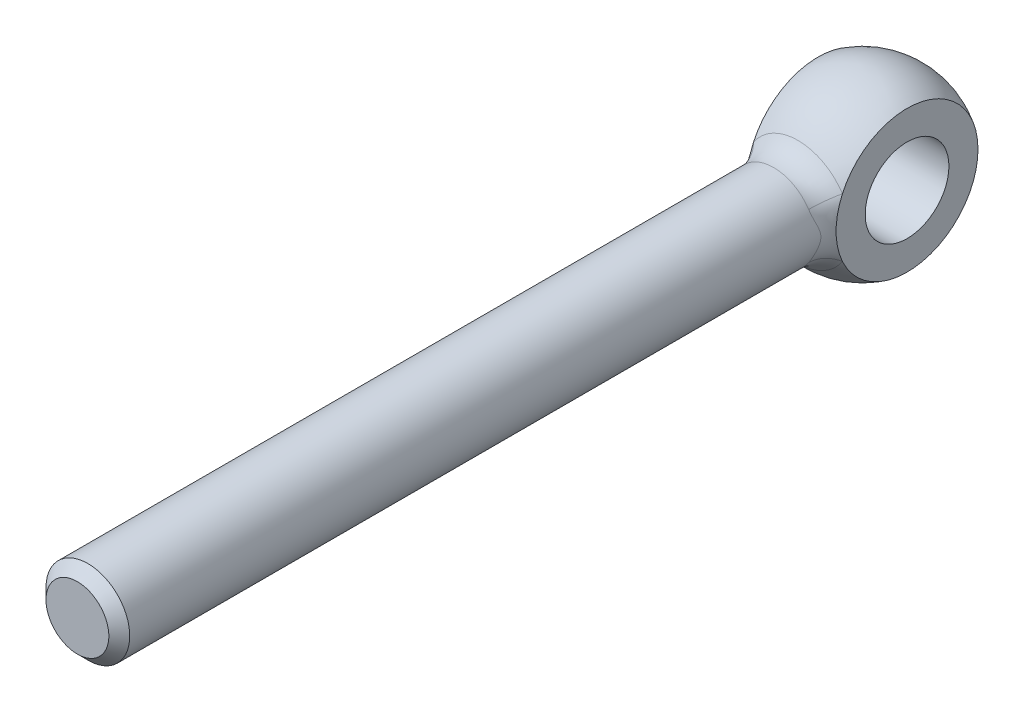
ISO-10303-21;
HEADER;
FILE_DESCRIPTION(('STEP AP214'),'2;1');
FILE_NAME('part.step','',(''),(''),'','','');
FILE_SCHEMA(('AUTOMOTIVE_DESIGN { 1 0 10303 214 1 1 1 1 }'));
ENDSEC;
DATA;
#1=APPLICATION_CONTEXT('core data for automotive mechanical design processes');
#2=APPLICATION_PROTOCOL_DEFINITION('international standard','automotive_design',2000,#1);
#3=PRODUCT_CONTEXT('',#1,'mechanical');
#4=PRODUCT('Part','Part','',(#3));
#5=PRODUCT_RELATED_PRODUCT_CATEGORY('part','',(#4));
#6=PRODUCT_DEFINITION_FORMATION('','',#4);
#7=PRODUCT_DEFINITION_CONTEXT('part definition',#1,'design');
#8=PRODUCT_DEFINITION('design','',#6,#7);
#9=PRODUCT_DEFINITION_SHAPE('','',#8);
#10=(LENGTH_UNIT() NAMED_UNIT(*) SI_UNIT(.MILLI.,.METRE.));
#11=(NAMED_UNIT(*) PLANE_ANGLE_UNIT() SI_UNIT($,.RADIAN.));
#12=(NAMED_UNIT(*) SI_UNIT($,.STERADIAN.) SOLID_ANGLE_UNIT());
#13=UNCERTAINTY_MEASURE_WITH_UNIT(LENGTH_MEASURE(1.E-05),#10,'distance_accuracy_value','');
#14=(GEOMETRIC_REPRESENTATION_CONTEXT(3) GLOBAL_UNCERTAINTY_ASSIGNED_CONTEXT((#13)) GLOBAL_UNIT_ASSIGNED_CONTEXT((#10,
#11,#12)) REPRESENTATION_CONTEXT('',''));
#15=CARTESIAN_POINT('',(0.,0.,0.));
#16=DIRECTION('',(0.,0.,1.));
#17=DIRECTION('',(1.,0.,0.));
#18=AXIS2_PLACEMENT_3D('',#15,#16,#17);
#19=CARTESIAN_POINT('',(0.,0.,0.));
#20=DIRECTION('',(1.,0.,0.));
#21=DIRECTION('',(0.,0.,-1.));
#22=AXIS2_PLACEMENT_3D('',#19,#20,#21);
#23=SPHERICAL_SURFACE('',#22,16.);
#24=CARTESIAN_POINT('',(-8.5,0.,0.));
#25=DIRECTION('',(-1.,0.,0.));
#26=DIRECTION('',(0.,0.,1.));
#27=AXIS2_PLACEMENT_3D('',#24,#25,#26);
#28=CIRCLE('',#27,13.555441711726);
#29=CARTESIAN_POINT('',(-8.5,-5.60530297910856,12.3422274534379));
#30=VERTEX_POINT('',#29);
#31=CARTESIAN_POINT('',(-8.5,5.60530297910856,12.3422274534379));
#32=VERTEX_POINT('',#31);
#33=EDGE_CURVE('E254',#30,#32,#28,.F.);
#34=ORIENTED_EDGE('',*,*,#33,.T.);
#35=CARTESIAN_POINT('',(0.,0.,12.3422274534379));
#36=DIRECTION('',(0.,0.,-1.));
#37=DIRECTION('',(-1.,0.,0.));
#38=AXIS2_PLACEMENT_3D('',#35,#36,#37);
#39=CIRCLE('',#38,10.1818181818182);
#40=CARTESIAN_POINT('',(8.5,5.60530297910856,12.3422274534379));
#41=VERTEX_POINT('',#40);
#42=EDGE_CURVE('E73',#32,#41,#39,.T.);
#43=ORIENTED_EDGE('',*,*,#42,.T.);
#44=CARTESIAN_POINT('',(8.5,0.,0.));
#45=DIRECTION('',(-1.,0.,0.));
#46=DIRECTION('',(0.,0.,1.));
#47=AXIS2_PLACEMENT_3D('',#44,#45,#46);
#48=CIRCLE('',#47,13.555441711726);
#49=CARTESIAN_POINT('',(8.5,-5.60530297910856,12.3422274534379));
#50=VERTEX_POINT('',#49);
#51=EDGE_CURVE('E61',#50,#41,#48,.F.);
#52=ORIENTED_EDGE('',*,*,#51,.F.);
#53=CARTESIAN_POINT('',(0.,0.,12.3422274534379));
#54=DIRECTION('',(0.,0.,-1.));
#55=DIRECTION('',(-1.,0.,0.));
#56=AXIS2_PLACEMENT_3D('',#53,#54,#55);
#57=CIRCLE('',#56,10.1818181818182);
#58=EDGE_CURVE('E70',#50,#30,#57,.T.);
#59=ORIENTED_EDGE('',*,*,#58,.T.);
#60=EDGE_LOOP('',(#34,#43,#52,#59));
#61=FACE_BOUND('',#60,.T.);
#62=ADVANCED_FACE('F14',(#61),#23,.T.);
#63=CARTESIAN_POINT('',(0.,0.,-10.));
#64=DIRECTION('',(0.,0.,-1.));
#65=DIRECTION('',(-1.,0.,0.));
#66=AXIS2_PLACEMENT_3D('',#63,#64,#65);
#67=CYLINDRICAL_SURFACE('',#66,8.);
#68=CARTESIAN_POINT('',(-8.5,-7.21404610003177,11.4763904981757));
#69=CARTESIAN_POINT('',(-6.09468235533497,-5.27266467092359,13.1301048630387));
#70=CARTESIAN_POINT('',(-5.37414329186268,-5.92609347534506,16.4980627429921));
#71=CARTESIAN_POINT('',(-8.5,-7.11248170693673,11.5402194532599));
#72=CARTESIAN_POINT('',(-6.12063583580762,-5.22673392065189,13.2143748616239));
#73=CARTESIAN_POINT('',(-5.47521745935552,-5.83447064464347,16.5670395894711));
#74=CARTESIAN_POINT('',(-8.5,-7.00912010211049,11.6033252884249));
#75=CARTESIAN_POINT('',(-6.15011431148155,-5.17869850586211,13.2964414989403));
#76=CARTESIAN_POINT('',(-5.57488056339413,-5.73934357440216,16.6279432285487));
#77=CARTESIAN_POINT('',(-8.5,-6.7982397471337,11.7281301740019));
#78=CARTESIAN_POINT('',(-6.215692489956,-5.07719834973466,13.4551022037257));
#79=CARTESIAN_POINT('',(-5.77047286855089,-5.54263123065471,16.7342322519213));
#80=CARTESIAN_POINT('',(-8.5,-6.6907209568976,11.7898292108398));
#81=CARTESIAN_POINT('',(-6.25173729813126,-5.02378952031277,13.5316930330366));
#82=CARTESIAN_POINT('',(-5.86640203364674,-5.44104589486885,16.7796174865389));
#83=CARTESIAN_POINT('',(-8.5,-6.47156647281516,11.9115249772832));
#84=CARTESIAN_POINT('',(-6.32984302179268,-4.91051988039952,13.6784476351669));
#85=CARTESIAN_POINT('',(-6.05310068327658,-5.23254090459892,16.8552890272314));
#86=CARTESIAN_POINT('',(-8.5,-6.3599565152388,11.9715291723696));
#87=CARTESIAN_POINT('',(-6.37181368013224,-4.85076320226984,13.7486505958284));
#88=CARTESIAN_POINT('',(-6.14389552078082,-5.12565346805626,16.8856565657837));
#89=CARTESIAN_POINT('',(-8.5,-6.13156871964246,12.0900958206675));
#90=CARTESIAN_POINT('',(-6.46106207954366,-4.72338837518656,13.8824437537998));
#91=CARTESIAN_POINT('',(-6.32014497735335,-4.90667898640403,16.9324624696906));
#92=CARTESIAN_POINT('',(-8.5,-6.01479321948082,12.1486589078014));
#93=CARTESIAN_POINT('',(-6.50828789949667,-4.65584636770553,13.9460595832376));
#94=CARTESIAN_POINT('',(-6.40560197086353,-4.79459429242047,16.9489070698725));
#95=CARTESIAN_POINT('',(-8.5,-5.84778357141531,12.2293170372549));
#96=CARTESIAN_POINT('',(-6.57728162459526,-4.55517969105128,14.0300382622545));
#97=CARTESIAN_POINT('',(-6.52079058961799,-4.63491294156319,16.9628056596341));
#98=CARTESIAN_POINT('',(-8.5,-5.79993799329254,12.252084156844));
#99=CARTESIAN_POINT('',(-6.59714554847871,-4.52598470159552,14.0532625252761));
#100=CARTESIAN_POINT('',(-6.55301829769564,-4.58923484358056,16.9657309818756));
#101=CARTESIAN_POINT('',(-8.5,-5.70332504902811,12.2973545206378));
#102=CARTESIAN_POINT('',(-6.63743945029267,-4.46617383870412,14.0985544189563));
#103=CARTESIAN_POINT('',(-6.61651666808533,-4.49720278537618,16.969609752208));
#104=CARTESIAN_POINT('',(-8.5,-5.65455783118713,12.3198578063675));
#105=CARTESIAN_POINT('',(-6.6578672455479,-4.43556289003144,14.1206247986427));
#106=CARTESIAN_POINT('',(-6.64778748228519,-4.45084893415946,16.9705635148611));
#107=CARTESIAN_POINT('',(-8.5,-5.44499233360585,12.4150343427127));
#108=CARTESIAN_POINT('',(-6.74556355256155,-4.30257834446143,14.2117377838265));
#109=CARTESIAN_POINT('',(-6.7787644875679,-4.25222888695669,16.9705602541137));
#110=CARTESIAN_POINT('',(-8.5,-5.27951608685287,12.4864255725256));
#111=CARTESIAN_POINT('',(-6.81544368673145,-4.1927768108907,14.2754759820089));
#112=CARTESIAN_POINT('',(-6.8738000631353,-4.09681174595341,16.9604462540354));
#113=CARTESIAN_POINT('',(-8.5,-4.93715685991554,12.6257147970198));
#114=CARTESIAN_POINT('',(-6.95729458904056,-3.95635337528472,14.389624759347));
#115=CARTESIAN_POINT('',(-7.052814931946,-3.7803320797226,16.9224918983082));
#116=CARTESIAN_POINT('',(-8.5,-4.76026476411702,12.6936099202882));
#117=CARTESIAN_POINT('',(-7.0292537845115,-3.82985839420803,14.4401471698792));
#118=CARTESIAN_POINT('',(-7.13678522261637,-3.61926509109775,16.8946372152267));
#119=CARTESIAN_POINT('',(-8.5,-4.39291482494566,12.8253889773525));
#120=CARTESIAN_POINT('',(-7.17229161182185,-3.55899929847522,14.527893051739));
#121=CARTESIAN_POINT('',(-7.29368177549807,-3.29171337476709,16.8239398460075));
#122=CARTESIAN_POINT('',(-8.5,-4.20238277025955,12.8892467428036));
#123=CARTESIAN_POINT('',(-7.24340117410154,-3.41463018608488,14.5651704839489));
#124=CARTESIAN_POINT('',(-7.36653960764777,-3.12520218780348,16.7810092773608));
#125=CARTESIAN_POINT('',(-8.5,-3.80753809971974,13.011354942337));
#126=CARTESIAN_POINT('',(-7.38096321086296,-3.10891477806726,14.6265101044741));
#127=CARTESIAN_POINT('',(-7.50042091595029,-2.78863622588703,16.6838597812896));
#128=CARTESIAN_POINT('',(-8.5,-3.60322970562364,13.0696070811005));
#129=CARTESIAN_POINT('',(-7.44749590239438,-2.94761815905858,14.6507009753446));
#130=CARTESIAN_POINT('',(-7.5614479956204,-2.61858254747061,16.6296443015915));
#131=CARTESIAN_POINT('',(-8.5,-3.17298584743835,13.1807823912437));
#132=CARTESIAN_POINT('',(-7.57474759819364,-2.60343332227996,14.6877992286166));
#133=CARTESIAN_POINT('',(-7.6733842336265,-2.27017167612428,16.5128228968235));
#134=CARTESIAN_POINT('',(-8.5,-2.94657965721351,13.2334877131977));
#135=CARTESIAN_POINT('',(-7.63536024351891,-2.41996241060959,14.7004519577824));
#136=CARTESIAN_POINT('',(-7.72392626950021,-2.09171968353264,16.4500108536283));
#137=CARTESIAN_POINT('',(-8.5,-2.47625290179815,13.329510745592));
#138=CARTESIAN_POINT('',(-7.74529937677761,-2.03634776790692,14.7158200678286));
#139=CARTESIAN_POINT('',(-7.81254675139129,-1.73163043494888,16.3242586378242));
#140=CARTESIAN_POINT('',(-8.5,-2.23231936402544,13.372821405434));
#141=CARTESIAN_POINT('',(-7.79475745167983,-1.83605562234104,14.7186001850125));
#142=CARTESIAN_POINT('',(-7.85061584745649,-1.54999089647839,16.2613184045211));
#143=CARTESIAN_POINT('',(-8.5,-1.72932083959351,13.4470484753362));
#144=CARTESIAN_POINT('',(-7.8788717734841,-1.42253007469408,14.7183148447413));
#145=CARTESIAN_POINT('',(-7.91382421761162,-1.18541297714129,16.1458563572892));
#146=CARTESIAN_POINT('',(-8.5,-1.47045127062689,13.4780956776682));
#147=CARTESIAN_POINT('',(-7.91381483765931,-1.20922522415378,14.7153404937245));
#148=CARTESIAN_POINT('',(-7.93910079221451,-1.00251072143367,16.0932277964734));
#149=CARTESIAN_POINT('',(-8.5,-1.07148728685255,13.5136874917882));
#150=CARTESIAN_POINT('',(-7.95363162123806,-0.880715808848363,14.7104020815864));
#151=CARTESIAN_POINT('',(-7.96751724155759,-0.726106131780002,16.0305359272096));
#152=CARTESIAN_POINT('',(-8.5,-0.9368122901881,13.5237186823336));
#153=CARTESIAN_POINT('',(-7.96480566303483,-0.769915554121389,14.7086788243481));
#154=CARTESIAN_POINT('',(-7.97540430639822,-0.633689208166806,16.0123535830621));
#155=CARTESIAN_POINT('',(-8.5,-0.664802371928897,13.539814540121));
#156=CARTESIAN_POINT('',(-7.98269305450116,-0.546269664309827,14.7056669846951));
#157=CARTESIAN_POINT('',(-7.98796994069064,-0.448291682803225,15.9827925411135));
#158=CARTESIAN_POINT('',(-8.5,-0.527468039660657,13.5458800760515));
#159=CARTESIAN_POINT('',(-7.98941651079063,-0.433369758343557,14.7043770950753));
#160=CARTESIAN_POINT('',(-7.99264921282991,-0.355311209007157,15.9714123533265));
#161=CARTESIAN_POINT('',(-8.5,-0.239654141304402,13.5541505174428));
#162=CARTESIAN_POINT('',(-7.99857317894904,-0.196892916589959,14.7025804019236));
#163=CARTESIAN_POINT('',(-7.99901593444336,-0.161126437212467,15.9558343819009));
#164=CARTESIAN_POINT('',(-8.5,-0.0890478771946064,13.5559842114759));
#165=CARTESIAN_POINT('',(-8.00059991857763,-0.0731434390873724,14.7021481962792));
#166=CARTESIAN_POINT('',(-8.00041586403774,-0.0598937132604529,15.9523278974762));
#167=CARTESIAN_POINT('',(-8.5,0.211895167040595,13.5546208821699));
#168=CARTESIAN_POINT('',(-7.9990922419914,0.174066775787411,14.7024570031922));
#169=CARTESIAN_POINT('',(-7.99937082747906,0.142512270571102,15.9549155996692));
#170=CARTESIAN_POINT('',(-8.5,0.362231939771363,13.5514237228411));
#171=CARTESIAN_POINT('',(-7.9955567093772,0.297606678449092,14.7031982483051));
#172=CARTESIAN_POINT('',(-7.99692575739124,0.243685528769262,15.961010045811));
#173=CARTESIAN_POINT('',(-8.5,0.660964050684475,13.5401445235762));
#174=CARTESIAN_POINT('',(-7.98305803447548,0.543100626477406,14.7055724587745));
#175=CARTESIAN_POINT('',(-7.98821555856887,0.445703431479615,15.9821361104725));
#176=CARTESIAN_POINT('',(-8.5,0.809356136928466,13.5320551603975));
#177=CARTESIAN_POINT('',(-7.97407893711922,0.665127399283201,14.7072081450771));
#178=CARTESIAN_POINT('',(-7.98194470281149,0.546547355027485,15.9971811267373));
#179=CARTESIAN_POINT('',(-8.5,1.10250796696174,13.5113317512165));
#180=CARTESIAN_POINT('',(-7.9510017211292,0.906226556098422,14.7107414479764));
#181=CARTESIAN_POINT('',(-7.96564184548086,0.74747091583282,16.0347055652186));
#182=CARTESIAN_POINT('',(-8.5,1.24726738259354,13.4986972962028));
#183=CARTESIAN_POINT('',(-7.93688956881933,1.02536545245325,14.7126404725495));
#184=CARTESIAN_POINT('',(-7.95560950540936,0.847550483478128,16.0571856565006));
#185=CARTESIAN_POINT('',(-8.5,1.53378246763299,13.4691681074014));
#186=CARTESIAN_POINT('',(-7.90378045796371,1.26114754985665,14.715921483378));
#187=CARTESIAN_POINT('',(-7.93172247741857,1.04788711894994,16.1079466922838));
#188=CARTESIAN_POINT('',(-8.5,1.67548812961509,13.4522283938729));
#189=CARTESIAN_POINT('',(-7.88471399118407,1.37780407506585,14.7172974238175));
#190=CARTESIAN_POINT('',(-7.91782727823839,1.14813420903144,16.1362882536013));
#191=CARTESIAN_POINT('',(-8.5,1.95382048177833,13.4146307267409));
#192=CARTESIAN_POINT('',(-7.84223580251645,1.60676183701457,14.7186738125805));
#193=CARTESIAN_POINT('',(-7.88631338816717,1.34768986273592,16.1966383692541));
#194=CARTESIAN_POINT('',(-8.5,2.09044619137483,13.3939720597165));
#195=CARTESIAN_POINT('',(-7.81880220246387,1.71910774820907,14.7186709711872));
#196=CARTESIAN_POINT('',(-7.86869398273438,1.44699824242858,16.2286476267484));
#197=CARTESIAN_POINT('',(-8.5,2.3584137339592,13.3493943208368));
#198=CARTESIAN_POINT('',(-7.76807987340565,1.93905894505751,14.7165469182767));
#199=CARTESIAN_POINT('',(-7.82977168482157,1.64463169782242,16.2945243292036));
#200=CARTESIAN_POINT('',(-8.5,2.48975817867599,13.3254768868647));
#201=CARTESIAN_POINT('',(-7.74077070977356,2.04670100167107,14.714420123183));
#202=CARTESIAN_POINT('',(-7.8084706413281,1.74295724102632,16.3283908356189));
#203=CARTESIAN_POINT('',(-8.5,2.7473176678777,13.274768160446));
#204=CARTESIAN_POINT('',(-7.68276575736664,2.25711370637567,14.7074369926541));
#205=CARTESIAN_POINT('',(-7.76218797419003,1.93869867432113,16.3964859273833));
#206=CARTESIAN_POINT('',(-8.5,2.87353237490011,13.2479766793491));
#207=CARTESIAN_POINT('',(-7.65204732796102,2.35990797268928,14.7025700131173));
#208=CARTESIAN_POINT('',(-7.73720610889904,2.03611450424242,16.4307145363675));
#209=CARTESIAN_POINT('',(-8.5,3.20930744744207,13.1718509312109));
#210=CARTESIAN_POINT('',(-7.56463249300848,2.6324037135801,14.6849450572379));
#211=CARTESIAN_POINT('',(-7.66441324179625,2.29923751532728,16.5223425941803));
#212=CARTESIAN_POINT('',(-8.5,3.41408001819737,13.1200716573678));
#213=CARTESIAN_POINT('',(-7.50515068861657,2.79695169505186,14.6690169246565));
#214=CARTESIAN_POINT('',(-7.61303164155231,2.46407698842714,16.5788489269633));
#215=CARTESIAN_POINT('',(-8.5,3.81011206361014,13.0105817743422));
#216=CARTESIAN_POINT('',(-7.38026116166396,3.11070989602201,14.6259549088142));
#217=CARTESIAN_POINT('',(-7.49942504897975,2.79079244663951,16.6841164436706));
#218=CARTESIAN_POINT('',(-8.5,4.00137310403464,12.9528718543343));
#219=CARTESIAN_POINT('',(-7.31476500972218,3.2599243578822,14.5987244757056));
#220=CARTESIAN_POINT('',(-7.4372013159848,2.95266877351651,16.7328785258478));
#221=CARTESIAN_POINT('',(-8.5,4.37000544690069,12.8331713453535));
#222=CARTESIAN_POINT('',(-7.18112598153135,3.5415527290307,14.5324431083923));
#223=CARTESIAN_POINT('',(-7.30250701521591,3.27155812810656,16.8185636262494));
#224=CARTESIAN_POINT('',(-8.5,4.54747917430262,12.7712204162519));
#225=CARTESIAN_POINT('',(-7.11294809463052,3.67405011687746,14.4933793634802));
#226=CARTESIAN_POINT('',(-7.2301261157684,3.42860043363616,16.8555818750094));
#227=CARTESIAN_POINT('',(-8.5,4.89131268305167,12.6435234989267));
#228=CARTESIAN_POINT('',(-6.97624175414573,3.92367860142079,14.4030930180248));
#229=CARTESIAN_POINT('',(-7.07492374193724,3.73837581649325,16.9153731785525));
#230=CARTESIAN_POINT('',(-8.5,5.05767311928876,12.5777777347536));
#231=CARTESIAN_POINT('',(-6.90769393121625,4.0407111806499,14.351757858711));
#232=CARTESIAN_POINT('',(-6.99210288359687,3.89110914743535,16.938147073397));
#233=CARTESIAN_POINT('',(-8.5,5.36183242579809,12.4508919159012));
#234=CARTESIAN_POINT('',(-6.78083422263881,4.24724413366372,14.2438012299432));
#235=CARTESIAN_POINT('',(-6.82646896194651,4.17409181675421,16.9653278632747));
#236=CARTESIAN_POINT('',(-8.5,5.50072306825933,12.3900837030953));
#237=CARTESIAN_POINT('',(-6.72220835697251,4.3383567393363,14.1883306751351));
#238=CARTESIAN_POINT('',(-6.74473582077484,4.3049164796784,16.9715357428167));
#239=CARTESIAN_POINT('',(-8.5,5.77121151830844,12.266426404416));
#240=CARTESIAN_POINT('',(-6.60877160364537,4.50955407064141,14.0685302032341));
#241=CARTESIAN_POINT('',(-6.57387157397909,4.56157646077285,16.969341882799));
#242=CARTESIAN_POINT('',(-8.5,5.90281103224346,12.2035778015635));
#243=CARTESIAN_POINT('',(-6.55399775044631,4.58954375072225,14.004143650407));
#244=CARTESIAN_POINT('',(-6.48474221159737,4.6874129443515,16.9609435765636));
#245=CARTESIAN_POINT('',(-8.5,6.1613047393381,12.0751601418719));
#246=CARTESIAN_POINT('',(-6.44915440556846,4.74066397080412,13.8661465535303));
#247=CARTESIAN_POINT('',(-6.29833410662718,4.93511082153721,16.9279706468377));
#248=CARTESIAN_POINT('',(-8.5,6.28810151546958,12.0095646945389));
#249=CARTESIAN_POINT('',(-6.3992307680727,4.81153733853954,13.7923798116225));
#250=CARTESIAN_POINT('',(-6.2009549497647,5.05688675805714,16.9031603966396));
#251=CARTESIAN_POINT('',(-8.5,6.5357434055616,11.8766028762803));
#252=CARTESIAN_POINT('',(-6.30620115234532,4.94457342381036,13.637089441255));
#253=CARTESIAN_POINT('',(-6.00003403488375,5.29375902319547,16.8359566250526));
#254=CARTESIAN_POINT('',(-8.5,6.65658306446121,11.8092349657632));
#255=CARTESIAN_POINT('',(-6.26317251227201,5.00663411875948,13.5555369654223));
#256=CARTESIAN_POINT('',(-5.89648681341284,5.40884924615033,16.7935473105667));
#257=CARTESIAN_POINT('',(-8.5,6.77474698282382,11.7410733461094));
#258=CARTESIAN_POINT('',(-6.22436009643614,5.06487398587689,13.4708703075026));
#259=CARTESIAN_POINT('',(-5.79035913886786,5.52012146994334,16.7417712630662));
#260=(BOUNDED_SURFACE() B_SPLINE_SURFACE(3,2,((#68,#69,#70),(#71,#72,#73),(#74,#75,#76),(#77,
#78,#79),(#80,#81,#82),(#83,#84,#85),(#86,#87,#88),(#89,#90,#91),(#92,#93,#94),(#95,#96,#97),
(#98,#99,#100),(#101,#102,#103),(#104,#105,#106),(#107,#108,#109),(#110,#111,#112),(#113,#114,
#115),(#116,#117,#118),(#119,#120,#121),(#122,#123,#124),(#125,#126,#127),(#128,#129,#130),
(#131,#132,#133),(#134,#135,#136),(#137,#138,#139),(#140,#141,#142),(#143,#144,#145),(#146,#147,
#148),(#149,#150,#151),(#152,#153,#154),(#155,#156,#157),(#158,#159,#160),(#161,#162,#163),
(#164,#165,#166),(#167,#168,#169),(#170,#171,#172),(#173,#174,#175),(#176,#177,#178),(#179,#180,
#181),(#182,#183,#184),(#185,#186,#187),(#188,#189,#190),(#191,#192,#193),(#194,#195,#196),
(#197,#198,#199),(#200,#201,#202),(#203,#204,#205),(#206,#207,#208),(#209,#210,#211),(#212,#213,
#214),(#215,#216,#217),(#218,#219,#220),(#221,#222,#223),(#224,#225,#226),(#227,#228,#229),
(#230,#231,#232),(#233,#234,#235),(#236,#237,#238),(#239,#240,#241),(#242,#243,#244),(#245,#246,
#247),(#248,#249,#250),(#251,#252,#253),(#254,#255,#256),(#257,#258,#259)),.UNSPECIFIED.,.F.,
.F.,.F.) B_SPLINE_SURFACE_WITH_KNOTS((4,2,2,2,2,2,2,2,2,2,2,2,2,2,2,2,2,2,2,2,2,2,2,2,2,2,2,2,2,
2,2,4),(3,3),(0.,0.745231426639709,1.49047004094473,2.23163223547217,2.97246235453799,
3.26605012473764,3.55959104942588,4.51498393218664,5.47114937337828,6.43298377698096,
7.39452475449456,8.38551461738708,9.37724565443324,10.3580939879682,10.8478915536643,
11.3375817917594,11.8688190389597,12.4000706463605,12.9321194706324,13.4642161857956,
14.002118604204,14.5401243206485,15.0778606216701,15.6156322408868,16.5371108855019,
17.4584825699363,18.3721796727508,19.2858228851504,20.0950945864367,20.9041760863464,
21.7251332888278,22.5468288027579),(0.,1.),
.UNSPECIFIED.) GEOMETRIC_REPRESENTATION_ITEM() RATIONAL_B_SPLINE_SURFACE(((1.,0.863427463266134,
1.),(1.,0.865862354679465,1.),(1.,0.868408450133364,1.),(1.,0.873700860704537,1.),(1.,
0.876447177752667,1.),(1.,0.882102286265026,1.),(1.,0.885010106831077,1.),(1.,0.89096432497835,
1.),(1.,0.89401065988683,1.),(1.,0.898329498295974,1.),(1.,0.89956260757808,1.),(1.,
0.90204033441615,1.),(1.,0.903284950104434,1.),(1.,0.908599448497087,1.),(1.,0.91271219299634,
1.),(1.,0.920912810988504,1.),(1.,0.925000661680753,1.),(1.,0.933046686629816,1.),(1.,
0.937003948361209,1.),(1.,0.94462957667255,1.),(1.,0.948298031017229,1.),(1.,0.955318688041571,
1.),(1.,0.958657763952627,1.),(1.,0.964735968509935,1.),(1.,0.967474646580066,1.),(1.,
0.972155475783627,1.),(1.,0.974106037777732,1.),(1.,0.976336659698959,1.),(1.,0.976964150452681,
1.),(1.,0.97797010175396,1.),(1.,0.978348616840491,1.),(1.,0.978864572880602,1.),(1.,
0.978978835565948,1.),(1.,0.978893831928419,1.),(1.,0.978694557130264,1.),(1.,0.977990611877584,
1.),(1.,0.977485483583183,1.),(1.,0.97618905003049,1.),(1.,0.97539771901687,1.),(1.,
0.973544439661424,1.),(1.,0.972479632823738,1.),(1.,0.970111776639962,1.),(1.,0.968808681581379,
1.),(1.,0.96599281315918,1.),(1.,0.96448014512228,1.),(1.,0.961271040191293,1.),(1.,
0.959574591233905,1.),(1.,0.954755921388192,1.),(1.,0.951480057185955,1.),(1.,0.944585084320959,
1.),(1.,0.940966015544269,1.),(1.,0.933532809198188,1.),(1.,0.929720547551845,1.),(1.,
0.92198630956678,1.),(1.,0.91806433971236,1.),(1.,0.910668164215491,1.),(1.,0.907193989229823,
1.),(1.,0.900316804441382,1.),(1.,0.896913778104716,1.),(1.,0.890194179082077,1.),(1.,
0.886879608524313,1.),(1.,0.880439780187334,1.),(1.,0.877314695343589,1.),(1.,0.874312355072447,1.))) REPRESENTATION_ITEM('') SURFACE());
#261=CARTESIAN_POINT('',(-5.79035913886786,5.52012146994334,16.7417712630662));
#262=CARTESIAN_POINT('',(-5.89648681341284,5.40884924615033,16.7935473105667));
#263=CARTESIAN_POINT('',(-6.00003403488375,5.29375902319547,16.8359566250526));
#264=CARTESIAN_POINT('',(-6.2009549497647,5.05688675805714,16.9031603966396));
#265=CARTESIAN_POINT('',(-6.29833410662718,4.93511082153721,16.9279706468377));
#266=CARTESIAN_POINT('',(-6.48474221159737,4.6874129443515,16.9609435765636));
#267=CARTESIAN_POINT('',(-6.57387157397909,4.56157646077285,16.969341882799));
#268=CARTESIAN_POINT('',(-6.74473582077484,4.3049164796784,16.9715357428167));
#269=CARTESIAN_POINT('',(-6.82646896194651,4.1740918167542,16.9653278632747));
#270=CARTESIAN_POINT('',(-6.99210288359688,3.89110914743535,16.938147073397));
#271=CARTESIAN_POINT('',(-7.07492374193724,3.73837581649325,16.9153731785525));
#272=CARTESIAN_POINT('',(-7.2301261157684,3.42860043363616,16.8555818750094));
#273=CARTESIAN_POINT('',(-7.30250701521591,3.27155812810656,16.8185636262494));
#274=CARTESIAN_POINT('',(-7.4372013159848,2.9526687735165,16.7328785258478));
#275=CARTESIAN_POINT('',(-7.49942504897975,2.79079244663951,16.6841164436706));
#276=CARTESIAN_POINT('',(-7.61303164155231,2.46407698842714,16.5788489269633));
#277=CARTESIAN_POINT('',(-7.66441324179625,2.29923751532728,16.5223425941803));
#278=CARTESIAN_POINT('',(-7.73720610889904,2.03611450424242,16.4307145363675));
#279=CARTESIAN_POINT('',(-7.76218797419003,1.93869867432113,16.3964859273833));
#280=CARTESIAN_POINT('',(-7.8084706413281,1.74295724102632,16.3283908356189));
#281=CARTESIAN_POINT('',(-7.82977168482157,1.64463169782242,16.2945243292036));
#282=CARTESIAN_POINT('',(-7.86869398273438,1.44699824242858,16.2286476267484));
#283=CARTESIAN_POINT('',(-7.88631338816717,1.34768986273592,16.1966383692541));
#284=CARTESIAN_POINT('',(-7.91782727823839,1.14813420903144,16.1362882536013));
#285=CARTESIAN_POINT('',(-7.93172247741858,1.04788711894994,16.1079466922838));
#286=CARTESIAN_POINT('',(-7.95560950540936,0.847550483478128,16.0571856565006));
#287=CARTESIAN_POINT('',(-7.96564184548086,0.74747091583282,16.0347055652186));
#288=CARTESIAN_POINT('',(-7.98194470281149,0.546547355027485,15.9971811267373));
#289=CARTESIAN_POINT('',(-7.98821555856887,0.445703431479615,15.9821361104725));
#290=CARTESIAN_POINT('',(-7.99692575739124,0.243685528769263,15.961010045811));
#291=CARTESIAN_POINT('',(-7.99937082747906,0.142512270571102,15.9549155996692));
#292=CARTESIAN_POINT('',(-8.00041586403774,-0.0598937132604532,15.9523278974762));
#293=CARTESIAN_POINT('',(-7.99901593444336,-0.161126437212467,15.9558343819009));
#294=CARTESIAN_POINT('',(-7.99264921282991,-0.355311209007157,15.9714123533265));
#295=CARTESIAN_POINT('',(-7.98796994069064,-0.448291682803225,15.9827925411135));
#296=CARTESIAN_POINT('',(-7.97540430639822,-0.633689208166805,16.0123535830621));
#297=CARTESIAN_POINT('',(-7.96751724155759,-0.726106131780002,16.0305359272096));
#298=CARTESIAN_POINT('',(-7.93910079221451,-1.00251072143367,16.0932277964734));
#299=CARTESIAN_POINT('',(-7.91382421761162,-1.18541297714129,16.1458563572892));
#300=CARTESIAN_POINT('',(-7.85061584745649,-1.54999089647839,16.2613184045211));
#301=CARTESIAN_POINT('',(-7.81254675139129,-1.73163043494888,16.3242586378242));
#302=CARTESIAN_POINT('',(-7.72392626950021,-2.09171968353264,16.4500108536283));
#303=CARTESIAN_POINT('',(-7.6733842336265,-2.27017167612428,16.5128228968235));
#304=CARTESIAN_POINT('',(-7.5614479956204,-2.61858254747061,16.6296443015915));
#305=CARTESIAN_POINT('',(-7.50042091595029,-2.78863622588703,16.6838597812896));
#306=CARTESIAN_POINT('',(-7.36653960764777,-3.12520218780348,16.7810092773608));
#307=CARTESIAN_POINT('',(-7.29368177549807,-3.29171337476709,16.8239398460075));
#308=CARTESIAN_POINT('',(-7.13678522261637,-3.61926509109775,16.8946372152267));
#309=CARTESIAN_POINT('',(-7.052814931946,-3.7803320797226,16.9224918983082));
#310=CARTESIAN_POINT('',(-6.8738000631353,-4.09681174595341,16.9604462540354));
#311=CARTESIAN_POINT('',(-6.7787644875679,-4.25222888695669,16.9705602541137));
#312=CARTESIAN_POINT('',(-6.64778748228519,-4.45084893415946,16.9705635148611));
#313=CARTESIAN_POINT('',(-6.61651666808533,-4.49720278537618,16.969609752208));
#314=CARTESIAN_POINT('',(-6.55301829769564,-4.58923484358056,16.9657309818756));
#315=CARTESIAN_POINT('',(-6.52079058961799,-4.63491294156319,16.9628056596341));
#316=CARTESIAN_POINT('',(-6.40560197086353,-4.79459429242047,16.9489070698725));
#317=CARTESIAN_POINT('',(-6.32014497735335,-4.90667898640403,16.9324624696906));
#318=CARTESIAN_POINT('',(-6.14389552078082,-5.12565346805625,16.8856565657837));
#319=CARTESIAN_POINT('',(-6.05310068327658,-5.23254090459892,16.8552890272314));
#320=CARTESIAN_POINT('',(-5.86640203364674,-5.44104589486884,16.7796174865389));
#321=CARTESIAN_POINT('',(-5.77047286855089,-5.54263123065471,16.7342322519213));
#322=CARTESIAN_POINT('',(-5.57488056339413,-5.73934357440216,16.6279432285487));
#323=CARTESIAN_POINT('',(-5.47521745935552,-5.83447064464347,16.5670395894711));
#324=CARTESIAN_POINT('',(-5.37414329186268,-5.92609347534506,16.4980627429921));
#325=B_SPLINE_CURVE_WITH_KNOTS('',3,(#261,#262,#263,#264,#265,#266,#267,#268,#269,#270,#271,
#272,#273,#274,#275,#276,#277,#278,#279,#280,#281,#282,#283,#284,#285,#286,#287,#288,#289,#290,
#291,#292,#293,#294,#295,#296,#297,#298,#299,#300,#301,#302,#303,#304,#305,#306,#307,#308,#309,
#310,#311,#312,#313,#314,#315,#316,#317,#318,#319,#320,#321,#322,#323,#324),.UNSPECIFIED.,.F.,
.F.,(4,2,2,2,2,2,2,2,2,2,2,2,2,2,2,2,2,2,2,2,2,2,2,2,2,2,2,2,2,2,2,4),(0.,0.821695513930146,
1.64265271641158,2.45173421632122,3.26100591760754,4.17464913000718,5.08834623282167,
6.00971791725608,6.93119656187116,7.46896818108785,8.00670448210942,8.54471019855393,
9.08261261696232,9.61470933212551,10.1467581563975,10.6780097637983,11.2092470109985,
11.6989372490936,12.1887348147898,13.1695831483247,14.1613141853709,15.1523040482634,
16.113845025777,17.0756794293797,18.0318448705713,18.9872377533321,19.2807786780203,
19.57436644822,20.3151965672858,21.0563587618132,21.8015973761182,22.5468288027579),.UNSPECIFIED.);
#326=CARTESIAN_POINT('',(-6.67857142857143,4.40416662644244,16.9705627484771));
#327=VERTEX_POINT('',#326);
#328=CARTESIAN_POINT('',(-6.67857142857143,-4.40416662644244,16.9705627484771));
#329=VERTEX_POINT('',#328);
#330=EDGE_CURVE('E86',#327,#329,#325,.T.);
#331=ORIENTED_EDGE('',*,*,#330,.T.);
#332=CARTESIAN_POINT('',(0.,0.,16.9705627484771));
#333=DIRECTION('',(0.,0.,-1.));
#334=DIRECTION('',(-1.,0.,0.));
#335=AXIS2_PLACEMENT_3D('',#332,#333,#334);
#336=CIRCLE('',#335,8.);
#337=CARTESIAN_POINT('',(6.67857142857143,-4.40416662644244,16.9705627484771));
#338=VERTEX_POINT('',#337);
#339=EDGE_CURVE('E9',#329,#338,#336,.F.);
#340=ORIENTED_EDGE('',*,*,#339,.T.);
#341=CARTESIAN_POINT('',(8.5,7.21404611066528,11.4763904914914));
#342=CARTESIAN_POINT('',(6.0946823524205,5.27266467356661,13.1301048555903));
#343=CARTESIAN_POINT('',(5.37414329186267,5.92609347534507,16.4980627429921));
#344=CARTESIAN_POINT('',(8.5,7.11248171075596,11.5402194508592));
#345=CARTESIAN_POINT('',(6.12063583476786,5.22673392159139,13.2143748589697));
#346=CARTESIAN_POINT('',(5.47521745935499,5.83447064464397,16.5670395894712));
#347=CARTESIAN_POINT('',(8.5,7.00912010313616,11.6033252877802));
#348=CARTESIAN_POINT('',(6.15011431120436,5.17869850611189,13.2964414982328));
#349=CARTESIAN_POINT('',(5.57488056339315,5.7393435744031,16.6279432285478));
#350=CARTESIAN_POINT('',(8.5,6.79823974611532,11.7281301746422));
#351=CARTESIAN_POINT('',(6.2156924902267,5.07719834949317,13.4551022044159));
#352=CARTESIAN_POINT('',(5.77047286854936,5.54263123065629,16.7342322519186));
#353=CARTESIAN_POINT('',(8.5,6.69072095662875,11.7898292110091));
#354=CARTESIAN_POINT('',(6.251737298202,5.02378952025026,13.5316930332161));
#355=CARTESIAN_POINT('',(5.86640203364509,5.4410458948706,16.7796174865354));
#356=CARTESIAN_POINT('',(8.5,6.47156647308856,11.9115249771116));
#357=CARTESIAN_POINT('',(6.32984302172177,4.91051988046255,13.6784476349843));
#358=CARTESIAN_POINT('',(6.05310068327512,5.23254090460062,16.8552890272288));
#359=CARTESIAN_POINT('',(8.5,6.35995651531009,11.9715291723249));
#360=CARTESIAN_POINT('',(6.37181368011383,4.85076320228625,13.7486505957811));
#361=CARTESIAN_POINT('',(6.14389552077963,5.1256534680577,16.8856565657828));
#362=CARTESIAN_POINT('',(8.5,6.13156871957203,12.0900958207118));
#363=CARTESIAN_POINT('',(6.46106207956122,4.72338837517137,13.8824437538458));
#364=CARTESIAN_POINT('',(6.32014497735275,4.90667898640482,16.932462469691));
#365=CARTESIAN_POINT('',(8.5,6.01479321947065,12.1486589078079));
#366=CARTESIAN_POINT('',(6.5082878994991,4.65584636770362,13.9460595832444));
#367=CARTESIAN_POINT('',(6.40560197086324,4.79459429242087,16.9489070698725));
#368=CARTESIAN_POINT('',(8.5,5.84778357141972,12.2293170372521));
#369=CARTESIAN_POINT('',(6.57728162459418,4.5551796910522,14.0300382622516));
#370=CARTESIAN_POINT('',(6.52079058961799,4.6349129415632,16.962805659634));
#371=CARTESIAN_POINT('',(8.5,5.79993799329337,12.2520841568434));
#372=CARTESIAN_POINT('',(6.59714554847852,4.5259847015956,14.0532625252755));
#373=CARTESIAN_POINT('',(6.55301829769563,4.58923484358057,16.9657309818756));
#374=CARTESIAN_POINT('',(8.5,5.70332504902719,12.2973545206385));
#375=CARTESIAN_POINT('',(6.63743945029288,4.466173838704,14.098554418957));
#376=CARTESIAN_POINT('',(6.61651666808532,4.49720278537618,16.969609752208));
#377=CARTESIAN_POINT('',(8.5,5.65455783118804,12.3198578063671));
#378=CARTESIAN_POINT('',(6.65786724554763,4.43556289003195,14.1206247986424));
#379=CARTESIAN_POINT('',(6.64778748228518,4.45084893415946,16.9705635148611));
#380=CARTESIAN_POINT('',(8.5,5.44499233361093,12.4150343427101));
#381=CARTESIAN_POINT('',(6.74556355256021,4.30257834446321,14.211737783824));
#382=CARTESIAN_POINT('',(6.7787644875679,4.25222888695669,16.9705602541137));
#383=CARTESIAN_POINT('',(8.5,5.27951608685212,12.4864255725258));
#384=CARTESIAN_POINT('',(6.81544368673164,4.19277681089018,14.2754759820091));
#385=CARTESIAN_POINT('',(6.8738000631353,4.09681174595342,16.9604462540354));
#386=CARTESIAN_POINT('',(8.5,4.93715685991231,12.6257147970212));
#387=CARTESIAN_POINT('',(6.95729458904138,3.95635337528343,14.3896247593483));
#388=CARTESIAN_POINT('',(7.052814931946,3.78033207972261,16.9224918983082));
#389=CARTESIAN_POINT('',(8.5,4.76026476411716,12.6936099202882));
#390=CARTESIAN_POINT('',(7.02925378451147,3.82985839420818,14.4401471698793));
#391=CARTESIAN_POINT('',(7.13678522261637,3.61926509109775,16.8946372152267));
#392=CARTESIAN_POINT('',(8.5,4.39291482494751,12.8253889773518));
#393=CARTESIAN_POINT('',(7.17229161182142,3.55899929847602,14.5278930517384));
#394=CARTESIAN_POINT('',(7.29368177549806,3.2917133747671,16.8239398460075));
#395=CARTESIAN_POINT('',(8.5,4.20238277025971,12.8892467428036));
#396=CARTESIAN_POINT('',(7.24340117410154,3.41463018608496,14.5651704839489));
#397=CARTESIAN_POINT('',(7.36653960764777,3.12520218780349,16.7810092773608));
#398=CARTESIAN_POINT('',(8.5,3.80753809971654,13.0113549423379));
#399=CARTESIAN_POINT('',(7.38096321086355,3.10891477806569,14.6265101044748));
#400=CARTESIAN_POINT('',(7.50042091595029,2.78863622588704,16.6838597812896));
#401=CARTESIAN_POINT('',(8.5,3.60322970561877,13.0696070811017));
#402=CARTESIAN_POINT('',(7.44749590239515,2.94761815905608,14.6507009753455));
#403=CARTESIAN_POINT('',(7.56144799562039,2.61858254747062,16.6296443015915));
#404=CARTESIAN_POINT('',(8.5,3.17298584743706,13.1807823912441));
#405=CARTESIAN_POINT('',(7.57474759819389,2.60343332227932,14.6877992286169));
#406=CARTESIAN_POINT('',(7.6733842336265,2.27017167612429,16.5128228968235));
#407=CARTESIAN_POINT('',(8.5,2.94657965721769,13.233487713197));
#408=CARTESIAN_POINT('',(7.63536024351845,2.41996241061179,14.7004519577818));
#409=CARTESIAN_POINT('',(7.72392626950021,2.09171968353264,16.4500108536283));
#410=CARTESIAN_POINT('',(8.5,2.47625290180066,13.3295107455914));
#411=CARTESIAN_POINT('',(7.74529937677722,2.03634776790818,14.7158200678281));
#412=CARTESIAN_POINT('',(7.81254675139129,1.73163043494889,16.3242586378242));
#413=CARTESIAN_POINT('',(8.5,2.23231936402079,13.3728214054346));
#414=CARTESIAN_POINT('',(7.7947574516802,1.8360556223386,14.7186001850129));
#415=CARTESIAN_POINT('',(7.85061584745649,1.5499908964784,16.2613184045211));
#416=CARTESIAN_POINT('',(8.5,1.72932083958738,13.4470484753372));
#417=CARTESIAN_POINT('',(7.87887177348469,1.42253007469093,14.718314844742));
#418=CARTESIAN_POINT('',(7.91382421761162,1.18541297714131,16.1458563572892));
#419=CARTESIAN_POINT('',(8.5,1.4704512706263,13.4780956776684));
#420=CARTESIAN_POINT('',(7.9138148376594,1.20922522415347,14.7153404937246));
#421=CARTESIAN_POINT('',(7.9391007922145,1.00251072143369,16.0932277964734));
#422=CARTESIAN_POINT('',(8.5,1.0714872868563,13.5136874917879));
#423=CARTESIAN_POINT('',(7.95363162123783,0.880715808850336,14.7104020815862));
#424=CARTESIAN_POINT('',(7.96751724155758,0.726106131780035,16.0305359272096));
#425=CARTESIAN_POINT('',(8.5,0.936812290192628,13.5237186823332));
#426=CARTESIAN_POINT('',(7.96480566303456,0.769915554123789,14.7086788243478));
#427=CARTESIAN_POINT('',(7.97540430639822,0.633689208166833,16.0123535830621));
#428=CARTESIAN_POINT('',(8.5,0.664802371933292,13.5398145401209));
#429=CARTESIAN_POINT('',(7.9826930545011,0.546269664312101,14.705666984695));
#430=CARTESIAN_POINT('',(7.98796994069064,0.44829168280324,15.9827925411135));
#431=CARTESIAN_POINT('',(8.5,0.527468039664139,13.5458800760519));
#432=CARTESIAN_POINT('',(7.98941651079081,0.433369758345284,14.7043770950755));
#433=CARTESIAN_POINT('',(7.99264921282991,0.355311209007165,15.9714123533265));
#434=CARTESIAN_POINT('',(8.5,0.239654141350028,13.554150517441));
#435=CARTESIAN_POINT('',(7.9985731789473,0.19689291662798,14.7025804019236));
#436=CARTESIAN_POINT('',(7.99901593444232,0.161126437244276,15.9558343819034));
#437=CARTESIAN_POINT('',(8.5,0.0890478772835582,13.5559842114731));
#438=CARTESIAN_POINT('',(8.00059991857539,0.0731434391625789,14.7021481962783));
#439=CARTESIAN_POINT('',(8.00041586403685,0.0598937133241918,15.9523278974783));
#440=CARTESIAN_POINT('',(8.5,-0.21189516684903,13.554620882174));
#441=CARTESIAN_POINT('',(7.99909224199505,-0.174066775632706,14.7024570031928));
#442=CARTESIAN_POINT('',(7.99937082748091,-0.142512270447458,15.9549155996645));
#443=CARTESIAN_POINT('',(8.5,-0.362231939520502,13.5514237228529));
#444=CARTESIAN_POINT('',(7.99555670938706,-0.297606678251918,14.7031982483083));
#445=CARTESIAN_POINT('',(7.99692575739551,-0.243685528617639,15.9610100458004));
#446=CARTESIAN_POINT('',(8.5,-0.660964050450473,13.5401445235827));
#447=CARTESIAN_POINT('',(7.98305803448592,-0.543100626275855,14.7055724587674));
#448=CARTESIAN_POINT('',(7.98821555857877,-0.445703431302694,15.9821361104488));
#449=CARTESIAN_POINT('',(8.5,-0.809356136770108,13.5320551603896));
#450=CARTESIAN_POINT('',(7.97407893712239,-0.665127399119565,14.7072081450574));
#451=CARTESIAN_POINT('',(7.98194470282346,-0.546547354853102,15.997181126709));
#452=CARTESIAN_POINT('',(8.5,-1.10250796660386,13.511331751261));
#453=CARTESIAN_POINT('',(7.95100172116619,-0.906226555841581,14.7107414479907));
#454=CARTESIAN_POINT('',(7.96564184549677,-0.747470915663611,16.0347055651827));
#455=CARTESIAN_POINT('',(8.5,-1.24726738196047,13.4986972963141));
#456=CARTESIAN_POINT('',(7.93688956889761,-1.02536545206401,14.7126404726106));
#457=CARTESIAN_POINT('',(7.95560950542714,-0.847550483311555,16.0571856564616));
#458=CARTESIAN_POINT('',(8.5,-1.53378246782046,13.4691681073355));
#459=CARTESIAN_POINT('',(7.90378045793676,-1.26114754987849,14.7159214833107));
#460=CARTESIAN_POINT('',(7.93172247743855,-1.04788711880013,16.1079466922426));
#461=CARTESIAN_POINT('',(8.5,-1.67548813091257,13.4522283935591));
#462=CARTESIAN_POINT('',(7.88471399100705,-1.37780407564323,14.7172974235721));
#463=CARTESIAN_POINT('',(7.91782727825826,-1.14813420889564,16.1362882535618));
#464=CARTESIAN_POINT('',(8.5,-1.95382048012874,13.4146307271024));
#465=CARTESIAN_POINT('',(7.84223580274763,-1.60676183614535,14.7186738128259));
#466=CARTESIAN_POINT('',(7.88631338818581,-1.3476898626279,16.1966383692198));
#467=CARTESIAN_POINT('',(8.5,-2.09044618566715,13.3939720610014));
#468=CARTESIAN_POINT('',(7.81880220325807,-1.71910774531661,14.7186709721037));
#469=CARTESIAN_POINT('',(7.86869398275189,-1.44699824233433,16.2286476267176));
#470=CARTESIAN_POINT('',(8.5,-2.35841373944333,13.3493943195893));
#471=CARTESIAN_POINT('',(7.76807987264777,-1.93905894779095,14.7165469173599));
#472=CARTESIAN_POINT('',(7.82977168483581,-1.64463169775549,16.2945243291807));
#473=CARTESIAN_POINT('',(8.5,-2.48975819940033,13.3254768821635));
#474=CARTESIAN_POINT('',(7.74077070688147,-2.04670101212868,14.7144201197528));
#475=CARTESIAN_POINT('',(7.80847064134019,-1.74295724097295,16.3283908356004));
#476=CARTESIAN_POINT('',(8.5,-2.74731764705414,13.2747681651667));
#477=CARTESIAN_POINT('',(7.68276576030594,-2.25711369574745,14.7074369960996));
#478=CARTESIAN_POINT('',(7.76218797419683,-1.93869867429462,16.396485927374));
#479=CARTESIAN_POINT('',(8.5,-2.8735322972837,13.2479766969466));
#480=CARTESIAN_POINT('',(7.65204733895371,-2.35990793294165,14.7025700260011));
#481=CARTESIAN_POINT('',(7.73720610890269,-2.03611450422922,16.4307145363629));
#482=CARTESIAN_POINT('',(8.5,-3.20930732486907,13.1718509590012));
#483=CARTESIAN_POINT('',(7.56463251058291,-2.63240365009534,14.684945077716));
#484=CARTESIAN_POINT('',(7.66441324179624,-2.2992375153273,16.5223425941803));
#485=CARTESIAN_POINT('',(8.5,-3.41407998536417,13.1200716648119));
#486=CARTESIAN_POINT('',(7.50515069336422,-2.79695167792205,14.6690169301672));
#487=CARTESIAN_POINT('',(7.6130316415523,-2.46407698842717,16.5788489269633));
#488=CARTESIAN_POINT('',(8.5,-3.81011209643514,13.0105817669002));
#489=CARTESIAN_POINT('',(7.38026115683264,-3.11070991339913,14.6259549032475));
#490=CARTESIAN_POINT('',(7.49942504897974,-2.79079244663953,16.6841164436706));
#491=CARTESIAN_POINT('',(8.5,-4.00137311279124,12.9528718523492));
#492=CARTESIAN_POINT('',(7.31476500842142,-3.25992436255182,14.598724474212));
#493=CARTESIAN_POINT('',(7.4372013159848,-2.9526687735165,16.7328785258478));
#494=CARTESIAN_POINT('',(8.5,-4.37000543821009,12.8331713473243));
#495=CARTESIAN_POINT('',(7.18112598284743,-3.54155272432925,14.5324431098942));
#496=CARTESIAN_POINT('',(7.30250701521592,-3.27155812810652,16.8185636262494));
#497=CARTESIAN_POINT('',(8.5,-4.54747917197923,12.7712204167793));
#498=CARTESIAN_POINT('',(7.11294809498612,-3.67405011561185,14.4933793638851));
#499=CARTESIAN_POINT('',(7.23012611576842,-3.42860043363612,16.8555818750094));
#500=CARTESIAN_POINT('',(8.5,-4.89131268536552,12.6435234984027));
#501=CARTESIAN_POINT('',(6.97624175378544,-3.92367860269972,14.4030930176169));
#502=CARTESIAN_POINT('',(7.07492374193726,-3.73837581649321,16.9153731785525));
#503=CARTESIAN_POINT('',(8.5,-5.05767311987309,12.5777777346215));
#504=CARTESIAN_POINT('',(6.90769393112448,-4.04071118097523,14.3517578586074));
#505=CARTESIAN_POINT('',(6.9921028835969,-3.89110914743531,16.938147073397));
#506=CARTESIAN_POINT('',(8.5,-5.36183242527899,12.4508919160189));
#507=CARTESIAN_POINT('',(6.78083422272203,-4.24724413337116,14.243801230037));
#508=CARTESIAN_POINT('',(6.82646896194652,-4.17409181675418,16.9653278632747));
#509=CARTESIAN_POINT('',(8.5,-5.50072306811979,12.3900837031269));
#510=CARTESIAN_POINT('',(6.72220835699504,-4.33835673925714,14.1883306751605));
#511=CARTESIAN_POINT('',(6.74473582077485,-4.30491647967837,16.9715357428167));
#512=CARTESIAN_POINT('',(8.5,-5.7712115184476,12.2664264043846));
#513=CARTESIAN_POINT('',(6.60877160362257,-4.50955407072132,14.0685302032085));
#514=CARTESIAN_POINT('',(6.57387157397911,-4.56157646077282,16.969341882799));
#515=CARTESIAN_POINT('',(8.5,-5.90281103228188,12.2035778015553));
#516=CARTESIAN_POINT('',(6.55399775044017,-4.58954375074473,14.0041436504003));
#517=CARTESIAN_POINT('',(6.48474221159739,-4.68741294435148,16.9609435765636));
#518=CARTESIAN_POINT('',(8.5,-6.16130473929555,12.075160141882));
#519=CARTESIAN_POINT('',(6.44915440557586,-4.74066397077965,13.8661465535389));
#520=CARTESIAN_POINT('',(6.29833410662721,-4.93511082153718,16.9279706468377));
#521=CARTESIAN_POINT('',(8.5,-6.28810151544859,12.0095646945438));
#522=CARTESIAN_POINT('',(6.39923076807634,-4.81153733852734,13.7923798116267));
#523=CARTESIAN_POINT('',(6.20095494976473,-5.05688675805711,16.9031603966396));
#524=CARTESIAN_POINT('',(8.5,-6.53574340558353,11.8766028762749));
#525=CARTESIAN_POINT('',(6.30620115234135,-4.94457342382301,13.6370894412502));
#526=CARTESIAN_POINT('',(6.00003403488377,-5.29375902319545,16.8359566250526));
#527=CARTESIAN_POINT('',(8.5,-6.65658306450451,11.8092349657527));
#528=CARTESIAN_POINT('',(6.26317251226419,-5.00663411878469,13.5555369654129));
#529=CARTESIAN_POINT('',(5.89648681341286,-5.40884924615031,16.7935473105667));
#530=CARTESIAN_POINT('',(8.5,-6.77474698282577,11.7410733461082));
#531=CARTESIAN_POINT('',(6.22436009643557,-5.0648739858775,13.4708703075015));
#532=CARTESIAN_POINT('',(5.79035913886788,-5.52012146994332,16.7417712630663));
#533=(BOUNDED_SURFACE() B_SPLINE_SURFACE(3,2,((#341,#342,#343),(#344,#345,#346),(#347,#348,
#349),(#350,#351,#352),(#353,#354,#355),(#356,#357,#358),(#359,#360,#361),(#362,#363,#364),
(#365,#366,#367),(#368,#369,#370),(#371,#372,#373),(#374,#375,#376),(#377,#378,#379),(#380,#381,
#382),(#383,#384,#385),(#386,#387,#388),(#389,#390,#391),(#392,#393,#394),(#395,#396,#397),
(#398,#399,#400),(#401,#402,#403),(#404,#405,#406),(#407,#408,#409),(#410,#411,#412),(#413,#414,
#415),(#416,#417,#418),(#419,#420,#421),(#422,#423,#424),(#425,#426,#427),(#428,#429,#430),
(#431,#432,#433),(#434,#435,#436),(#437,#438,#439),(#440,#441,#442),(#443,#444,#445),(#446,#447,
#448),(#449,#450,#451),(#452,#453,#454),(#455,#456,#457),(#458,#459,#460),(#461,#462,#463),
(#464,#465,#466),(#467,#468,#469),(#470,#471,#472),(#473,#474,#475),(#476,#477,#478),(#479,#480,
#481),(#482,#483,#484),(#485,#486,#487),(#488,#489,#490),(#491,#492,#493),(#494,#495,#496),
(#497,#498,#499),(#500,#501,#502),(#503,#504,#505),(#506,#507,#508),(#509,#510,#511),(#512,#513,
#514),(#515,#516,#517),(#518,#519,#520),(#521,#522,#523),(#524,#525,#526),(#527,#528,#529),
(#530,#531,#532)),.UNSPECIFIED.,.F.,.F.,.F.) B_SPLINE_SURFACE_WITH_KNOTS((4,2,2,2,2,2,2,2,2,2,2,
2,2,2,2,2,2,2,2,2,2,2,2,2,2,2,2,2,2,2,2,4),(3,3),(0.,0.745231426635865,1.49047004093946,
2.23163223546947,2.97246235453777,3.26605012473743,3.55959104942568,4.51498393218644,
5.47114937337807,6.43298377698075,7.39452475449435,8.38551461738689,9.37724565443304,
10.3580939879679,10.8478915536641,11.3375817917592,11.8688190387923,12.4000706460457,
12.932119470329,13.4642161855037,14.0021186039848,14.5401243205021,15.0778606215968,
15.6156322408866,16.5371108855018,17.4584825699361,18.3721796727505,19.2858228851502,
20.0950945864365,20.9041760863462,21.7251332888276,22.5468288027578),(0.,1.),
.UNSPECIFIED.) GEOMETRIC_REPRESENTATION_ITEM() RATIONAL_B_SPLINE_SURFACE(((1.,0.863427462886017,
1.),(1.,0.865862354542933,1.),(1.,0.868408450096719,1.),(1.,0.873700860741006,1.),(1.,
0.876447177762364,1.),(1.,0.882102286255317,1.),(1.,0.885010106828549,1.),(1.,0.890964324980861,
1.),(1.,0.894010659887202,1.),(1.,0.898329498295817,1.),(1.,0.899562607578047,1.),(1.,
0.902040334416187,1.),(1.,0.903284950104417,1.),(1.,0.908599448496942,1.),(1.,0.912712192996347,
1.),(1.,0.920912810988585,1.),(1.,0.925000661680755,1.),(1.,0.933046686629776,1.),(1.,
0.937003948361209,1.),(1.,0.944629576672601,1.),(1.,0.948298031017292,1.),(1.,0.955318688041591,
1.),(1.,0.95865776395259,1.),(1.,0.964735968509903,1.),(1.,0.967474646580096,1.),(1.,
0.972155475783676,1.),(1.,0.974106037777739,1.),(1.,0.976336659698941,1.),(1.,0.97696415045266,
1.),(1.,0.977970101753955,1.),(1.,0.978348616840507,1.),(1.,0.978864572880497,1.),(1.,
0.978978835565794,1.),(1.,0.978893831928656,1.),(1.,0.97869455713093,1.),(1.,0.977990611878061,
1.),(1.,0.977485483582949,1.),(1.,0.976189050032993,1.),(1.,0.975397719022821,1.),(1.,
0.973544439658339,1.),(1.,0.972479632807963,1.),(1.,0.970111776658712,1.),(1.,0.968808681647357,
1.),(1.,0.96599281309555,1.),(1.,0.964480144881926,1.),(1.,0.9612710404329,1.),(1.,
0.95957459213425,1.),(1.,0.954755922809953,1.),(1.,0.9514800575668,1.),(1.,0.944585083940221,
1.),(1.,0.94096601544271,1.),(1.,0.933532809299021,1.),(1.,0.929720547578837,1.),(1.,
0.921986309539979,1.),(1.,0.918064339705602,1.),(1.,0.910668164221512,1.),(1.,0.907193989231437,
1.),(1.,0.900316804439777,1.),(1.,0.8969137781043,1.),(1.,0.8901941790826,1.),(1.,
0.886879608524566,1.),(1.,0.880439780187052,1.),(1.,0.877314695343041,1.),(1.,0.874312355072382,1.))) REPRESENTATION_ITEM('') SURFACE());
#534=CARTESIAN_POINT('',(5.79035913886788,-5.52012146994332,16.7417712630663));
#535=CARTESIAN_POINT('',(5.89648681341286,-5.40884924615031,16.7935473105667));
#536=CARTESIAN_POINT('',(6.00003403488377,-5.29375902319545,16.8359566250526));
#537=CARTESIAN_POINT('',(6.20095494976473,-5.05688675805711,16.9031603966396));
#538=CARTESIAN_POINT('',(6.29833410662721,-4.93511082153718,16.9279706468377));
#539=CARTESIAN_POINT('',(6.48474221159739,-4.68741294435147,16.9609435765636));
#540=CARTESIAN_POINT('',(6.57387157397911,-4.56157646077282,16.969341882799));
#541=CARTESIAN_POINT('',(6.74473582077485,-4.30491647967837,16.9715357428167));
#542=CARTESIAN_POINT('',(6.82646896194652,-4.17409181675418,16.9653278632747));
#543=CARTESIAN_POINT('',(6.9921028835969,-3.89110914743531,16.938147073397));
#544=CARTESIAN_POINT('',(7.07492374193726,-3.73837581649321,16.9153731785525));
#545=CARTESIAN_POINT('',(7.23012611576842,-3.42860043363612,16.8555818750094));
#546=CARTESIAN_POINT('',(7.30250701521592,-3.27155812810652,16.8185636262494));
#547=CARTESIAN_POINT('',(7.4372013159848,-2.9526687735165,16.7328785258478));
#548=CARTESIAN_POINT('',(7.49942504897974,-2.79079244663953,16.6841164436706));
#549=CARTESIAN_POINT('',(7.6130316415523,-2.46407698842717,16.5788489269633));
#550=CARTESIAN_POINT('',(7.66441324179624,-2.2992375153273,16.5223425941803));
#551=CARTESIAN_POINT('',(7.73720610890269,-2.03611450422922,16.4307145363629));
#552=CARTESIAN_POINT('',(7.76218797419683,-1.93869867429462,16.396485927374));
#553=CARTESIAN_POINT('',(7.80847064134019,-1.74295724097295,16.3283908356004));
#554=CARTESIAN_POINT('',(7.82977168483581,-1.64463169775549,16.2945243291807));
#555=CARTESIAN_POINT('',(7.86869398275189,-1.44699824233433,16.2286476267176));
#556=CARTESIAN_POINT('',(7.88631338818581,-1.3476898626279,16.1966383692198));
#557=CARTESIAN_POINT('',(7.91782727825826,-1.14813420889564,16.1362882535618));
#558=CARTESIAN_POINT('',(7.93172247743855,-1.04788711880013,16.1079466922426));
#559=CARTESIAN_POINT('',(7.95560950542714,-0.847550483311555,16.0571856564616));
#560=CARTESIAN_POINT('',(7.96564184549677,-0.747470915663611,16.0347055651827));
#561=CARTESIAN_POINT('',(7.98194470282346,-0.546547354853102,15.997181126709));
#562=CARTESIAN_POINT('',(7.98821555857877,-0.445703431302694,15.9821361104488));
#563=CARTESIAN_POINT('',(7.99692575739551,-0.243685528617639,15.9610100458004));
#564=CARTESIAN_POINT('',(7.99937082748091,-0.142512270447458,15.9549155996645));
#565=CARTESIAN_POINT('',(8.00041586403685,0.0598937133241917,15.9523278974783));
#566=CARTESIAN_POINT('',(7.99901593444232,0.161126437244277,15.9558343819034));
#567=CARTESIAN_POINT('',(7.99264921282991,0.355311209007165,15.9714123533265));
#568=CARTESIAN_POINT('',(7.98796994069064,0.44829168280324,15.9827925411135));
#569=CARTESIAN_POINT('',(7.97540430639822,0.633689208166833,16.0123535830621));
#570=CARTESIAN_POINT('',(7.96751724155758,0.726106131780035,16.0305359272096));
#571=CARTESIAN_POINT('',(7.93910079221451,1.00251072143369,16.0932277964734));
#572=CARTESIAN_POINT('',(7.91382421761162,1.18541297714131,16.1458563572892));
#573=CARTESIAN_POINT('',(7.85061584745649,1.5499908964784,16.2613184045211));
#574=CARTESIAN_POINT('',(7.81254675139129,1.73163043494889,16.3242586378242));
#575=CARTESIAN_POINT('',(7.72392626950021,2.09171968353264,16.4500108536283));
#576=CARTESIAN_POINT('',(7.6733842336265,2.27017167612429,16.5128228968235));
#577=CARTESIAN_POINT('',(7.56144799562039,2.61858254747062,16.6296443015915));
#578=CARTESIAN_POINT('',(7.50042091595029,2.78863622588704,16.6838597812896));
#579=CARTESIAN_POINT('',(7.36653960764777,3.12520218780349,16.7810092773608));
#580=CARTESIAN_POINT('',(7.29368177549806,3.2917133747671,16.8239398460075));
#581=CARTESIAN_POINT('',(7.13678522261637,3.61926509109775,16.8946372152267));
#582=CARTESIAN_POINT('',(7.052814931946,3.78033207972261,16.9224918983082));
#583=CARTESIAN_POINT('',(6.8738000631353,4.09681174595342,16.9604462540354));
#584=CARTESIAN_POINT('',(6.7787644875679,4.2522288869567,16.9705602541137));
#585=CARTESIAN_POINT('',(6.64778748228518,4.45084893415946,16.9705635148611));
#586=CARTESIAN_POINT('',(6.61651666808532,4.49720278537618,16.969609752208));
#587=CARTESIAN_POINT('',(6.55301829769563,4.58923484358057,16.9657309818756));
#588=CARTESIAN_POINT('',(6.52079058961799,4.6349129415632,16.962805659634));
#589=CARTESIAN_POINT('',(6.40560197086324,4.79459429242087,16.9489070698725));
#590=CARTESIAN_POINT('',(6.32014497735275,4.90667898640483,16.932462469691));
#591=CARTESIAN_POINT('',(6.14389552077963,5.1256534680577,16.8856565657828));
#592=CARTESIAN_POINT('',(6.05310068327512,5.23254090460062,16.8552890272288));
#593=CARTESIAN_POINT('',(5.8664020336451,5.4410458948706,16.7796174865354));
#594=CARTESIAN_POINT('',(5.77047286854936,5.54263123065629,16.7342322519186));
#595=CARTESIAN_POINT('',(5.57488056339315,5.7393435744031,16.6279432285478));
#596=CARTESIAN_POINT('',(5.47521745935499,5.83447064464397,16.5670395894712));
#597=CARTESIAN_POINT('',(5.37414329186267,5.92609347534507,16.4980627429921));
#598=B_SPLINE_CURVE_WITH_KNOTS('',3,(#534,#535,#536,#537,#538,#539,#540,#541,#542,#543,#544,
#545,#546,#547,#548,#549,#550,#551,#552,#553,#554,#555,#556,#557,#558,#559,#560,#561,#562,#563,
#564,#565,#566,#567,#568,#569,#570,#571,#572,#573,#574,#575,#576,#577,#578,#579,#580,#581,#582,
#583,#584,#585,#586,#587,#588,#589,#590,#591,#592,#593,#594,#595,#596,#597),.UNSPECIFIED.,.F.,
.F.,(4,2,2,2,2,2,2,2,2,2,2,2,2,2,2,2,2,2,2,2,2,2,2,2,2,2,2,2,2,2,2,4),(0.,0.821695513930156,
1.64265271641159,2.45173421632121,3.26100591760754,4.17464913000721,5.08834623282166,
6.00971791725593,6.93119656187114,7.46896818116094,8.00670448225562,8.54471019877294,
9.08261261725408,9.61470933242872,10.146758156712,10.6780097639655,11.2092470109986,
11.6989372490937,12.1887348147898,13.1695831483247,14.1613141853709,15.1523040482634,
16.113845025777,17.0756794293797,18.0318448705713,18.9872377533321,19.2807786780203,
19.57436644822,20.3151965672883,21.0563587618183,21.8015973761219,22.5468288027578),.UNSPECIFIED.);
#599=CARTESIAN_POINT('',(6.67857142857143,4.40416662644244,16.9705627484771));
#600=VERTEX_POINT('',#599);
#601=EDGE_CURVE('E27',#338,#600,#598,.T.);
#602=ORIENTED_EDGE('',*,*,#601,.T.);
#603=CARTESIAN_POINT('',(0.,0.,16.9705627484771));
#604=DIRECTION('',(0.,0.,-1.));
#605=DIRECTION('',(-1.,0.,0.));
#606=AXIS2_PLACEMENT_3D('',#603,#604,#605);
#607=CIRCLE('',#606,8.);
#608=EDGE_CURVE('E97',#600,#327,#607,.F.);
#609=ORIENTED_EDGE('',*,*,#608,.T.);
#610=EDGE_LOOP('',(#331,#340,#602,#609));
#611=FACE_BOUND('',#610,.T.);
#612=CARTESIAN_POINT('',(0.,0.,148.));
#613=DIRECTION('',(0.,0.,-1.));
#614=DIRECTION('',(-1.,0.,0.));
#615=AXIS2_PLACEMENT_3D('',#612,#613,#614);
#616=CIRCLE('',#615,8.);
#617=CARTESIAN_POINT('',(-8.,0.,148.));
#618=VERTEX_POINT('',#617);
#619=EDGE_CURVE('E256',#618,#618,#616,.T.);
#620=ORIENTED_EDGE('',*,*,#619,.T.);
#621=EDGE_LOOP('',(#620));
#622=FACE_BOUND('',#621,.T.);
#623=ADVANCED_FACE('F103',(#611,#622),#67,.T.);
#624=CARTESIAN_POINT('',(0.,0.,150.));
#625=DIRECTION('',(0.,0.,-1.));
#626=DIRECTION('',(-1.,0.,0.));
#627=AXIS2_PLACEMENT_3D('',#624,#625,#626);
#628=CONICAL_SURFACE('',#627,6.,0.785398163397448);
#629=ORIENTED_EDGE('',*,*,#619,.F.);
#630=EDGE_LOOP('',(#629));
#631=FACE_BOUND('',#630,.T.);
#632=CARTESIAN_POINT('',(0.,0.,150.));
#633=DIRECTION('',(0.,0.,-1.));
#634=DIRECTION('',(-1.,0.,0.));
#635=AXIS2_PLACEMENT_3D('',#632,#633,#634);
#636=CIRCLE('',#635,6.);
#637=CARTESIAN_POINT('',(-6.,0.,150.));
#638=VERTEX_POINT('',#637);
#639=EDGE_CURVE('E65',#638,#638,#636,.T.);
#640=ORIENTED_EDGE('',*,*,#639,.T.);
#641=EDGE_LOOP('',(#640));
#642=FACE_BOUND('',#641,.T.);
#643=ADVANCED_FACE('F108',(#631,#642),#628,.T.);
#644=CARTESIAN_POINT('',(0.,6.,150.));
#645=DIRECTION('',(0.,0.,1.));
#646=DIRECTION('',(1.,0.,0.));
#647=AXIS2_PLACEMENT_3D('',#644,#645,#646);
#648=PLANE('',#647);
#649=ORIENTED_EDGE('',*,*,#639,.F.);
#650=EDGE_LOOP('',(#649));
#651=FACE_BOUND('',#650,.T.);
#652=ADVANCED_FACE('F168',(#651),#648,.T.);
#653=CARTESIAN_POINT('',(8.5,-15.,-19.9999999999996));
#654=DIRECTION('',(-1.,0.,0.));
#655=DIRECTION('',(0.,0.,1.));
#656=AXIS2_PLACEMENT_3D('',#653,#654,#655);
#657=PLANE('',#656);
#658=ORIENTED_EDGE('',*,*,#51,.T.);
#659=EDGE_CURVE('E57',#41,#50,#48,.F.);
#660=ORIENTED_EDGE('',*,*,#659,.T.);
#661=EDGE_LOOP('',(#658,#660));
#662=FACE_BOUND('',#661,.T.);
#663=CARTESIAN_POINT('',(8.5,0.,0.));
#664=DIRECTION('',(1.,0.,0.));
#665=DIRECTION('',(0.,0.,-1.));
#666=AXIS2_PLACEMENT_3D('',#663,#664,#665);
#667=CIRCLE('',#666,8.);
#668=CARTESIAN_POINT('',(8.5,0.,-8.));
#669=VERTEX_POINT('',#668);
#670=EDGE_CURVE('E247',#669,#669,#667,.T.);
#671=ORIENTED_EDGE('',*,*,#670,.F.);
#672=EDGE_LOOP('',(#671));
#673=FACE_BOUND('',#672,.T.);
#674=ADVANCED_FACE('F59',(#662,#673),#657,.F.);
#675=CARTESIAN_POINT('',(-8.5,-15.,-19.9999999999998));
#676=DIRECTION('',(-1.,0.,0.));
#677=DIRECTION('',(0.,0.,1.));
#678=AXIS2_PLACEMENT_3D('',#675,#676,#677);
#679=PLANE('',#678);
#680=ORIENTED_EDGE('',*,*,#33,.F.);
#681=EDGE_CURVE('E78',#32,#30,#28,.F.);
#682=ORIENTED_EDGE('',*,*,#681,.F.);
#683=EDGE_LOOP('',(#680,#682));
#684=FACE_BOUND('',#683,.T.);
#685=CARTESIAN_POINT('',(-8.5,0.,0.));
#686=DIRECTION('',(-1.,0.,0.));
#687=DIRECTION('',(0.,0.,1.));
#688=AXIS2_PLACEMENT_3D('',#685,#686,#687);
#689=CIRCLE('',#688,8.);
#690=CARTESIAN_POINT('',(-8.5,0.,8.));
#691=VERTEX_POINT('',#690);
#692=EDGE_CURVE('E135',#691,#691,#689,.F.);
#693=ORIENTED_EDGE('',*,*,#692,.T.);
#694=EDGE_LOOP('',(#693));
#695=FACE_BOUND('',#694,.T.);
#696=ADVANCED_FACE('F110',(#684,#695),#679,.T.);
#697=CARTESIAN_POINT('',(11.6875,7.70729159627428,16.9705627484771));
#698=DIRECTION('',(-0.550520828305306,0.834821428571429,0.));
#699=DIRECTION('',(0.834821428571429,0.550520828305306,0.));
#700=AXIS2_PLACEMENT_3D('',#697,#698,#699);
#701=CIRCLE('',#700,6.);
#702=EDGE_CURVE('E79',#600,#41,#701,.F.);
#703=ORIENTED_EDGE('',*,*,#702,.F.);
#704=ORIENTED_EDGE('',*,*,#601,.F.);
#705=CARTESIAN_POINT('',(11.6875,-7.70729159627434,16.9705627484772));
#706=DIRECTION('',(0.550520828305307,0.834821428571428,0.));
#707=DIRECTION('',(0.834821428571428,-0.550520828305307,0.));
#708=AXIS2_PLACEMENT_3D('',#705,#706,#707);
#709=CIRCLE('',#708,6.);
#710=EDGE_CURVE('E75',#50,#338,#709,.T.);
#711=ORIENTED_EDGE('',*,*,#710,.F.);
#712=ORIENTED_EDGE('',*,*,#659,.F.);
#713=EDGE_LOOP('',(#703,#704,#711,#712));
#714=FACE_BOUND('',#713,.T.);
#715=ADVANCED_FACE('F76',(#714),#533,.F.);
#716=CARTESIAN_POINT('',(0.,0.,16.9705627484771));
#717=DIRECTION('',(0.,0.,-1.));
#718=DIRECTION('',(-1.,0.,0.));
#719=AXIS2_PLACEMENT_3D('',#716,#717,#718);
#720=TOROIDAL_SURFACE('',#719,14.,6.);
#721=ORIENTED_EDGE('',*,*,#710,.T.);
#722=ORIENTED_EDGE('',*,*,#339,.F.);
#723=CARTESIAN_POINT('',(-11.6875,-7.70729159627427,16.9705627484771));
#724=DIRECTION('',(0.550520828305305,-0.834821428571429,0.));
#725=DIRECTION('',(-0.834821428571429,-0.550520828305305,0.));
#726=AXIS2_PLACEMENT_3D('',#723,#724,#725);
#727=CIRCLE('',#726,6.);
#728=EDGE_CURVE('E83',#30,#329,#727,.T.);
#729=ORIENTED_EDGE('',*,*,#728,.F.);
#730=ORIENTED_EDGE('',*,*,#58,.F.);
#731=EDGE_LOOP('',(#721,#722,#729,#730));
#732=FACE_BOUND('',#731,.T.);
#733=ADVANCED_FACE('F82',(#732),#720,.F.);
#734=CARTESIAN_POINT('',(0.,0.,16.9705627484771));
#735=DIRECTION('',(0.,0.,-1.));
#736=DIRECTION('',(-1.,0.,0.));
#737=AXIS2_PLACEMENT_3D('',#734,#735,#736);
#738=TOROIDAL_SURFACE('',#737,14.,6.);
#739=ORIENTED_EDGE('',*,*,#702,.T.);
#740=ORIENTED_EDGE('',*,*,#42,.F.);
#741=CARTESIAN_POINT('',(-11.6875,7.70729159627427,16.9705627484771));
#742=DIRECTION('',(0.550520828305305,0.834821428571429,0.));
#743=DIRECTION('',(0.834821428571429,-0.550520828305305,0.));
#744=AXIS2_PLACEMENT_3D('',#741,#742,#743);
#745=CIRCLE('',#744,6.);
#746=EDGE_CURVE('E133',#327,#32,#745,.T.);
#747=ORIENTED_EDGE('',*,*,#746,.F.);
#748=ORIENTED_EDGE('',*,*,#608,.F.);
#749=EDGE_LOOP('',(#739,#740,#747,#748));
#750=FACE_BOUND('',#749,.T.);
#751=ADVANCED_FACE('F201',(#750),#738,.F.);
#752=ORIENTED_EDGE('',*,*,#728,.T.);
#753=ORIENTED_EDGE('',*,*,#330,.F.);
#754=ORIENTED_EDGE('',*,*,#746,.T.);
#755=ORIENTED_EDGE('',*,*,#681,.T.);
#756=EDGE_LOOP('',(#752,#753,#754,#755));
#757=FACE_BOUND('',#756,.T.);
#758=ADVANCED_FACE('F114',(#757),#260,.F.);
#759=CARTESIAN_POINT('',(-37.1504774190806,0.,0.));
#760=DIRECTION('',(1.,0.,0.));
#761=DIRECTION('',(0.,0.,-1.));
#762=AXIS2_PLACEMENT_3D('',#759,#760,#761);
#763=CYLINDRICAL_SURFACE('',#762,8.);
#764=ORIENTED_EDGE('',*,*,#670,.T.);
#765=EDGE_LOOP('',(#764));
#766=FACE_BOUND('',#765,.T.);
#767=ORIENTED_EDGE('',*,*,#692,.F.);
#768=EDGE_LOOP('',(#767));
#769=FACE_BOUND('',#768,.T.);
#770=ADVANCED_FACE('F215',(#766,#769),#763,.F.);
#771=CLOSED_SHELL('',(#62,#623,#643,#652,#674,#696,#715,#733,#751,#758,#770));
#772=MANIFOLD_SOLID_BREP('B1',#771);
#773=ADVANCED_BREP_SHAPE_REPRESENTATION('',(#18,#772),#14);
#774=SHAPE_DEFINITION_REPRESENTATION(#9,#773);
ENDSEC;
END-ISO-10303-21;
